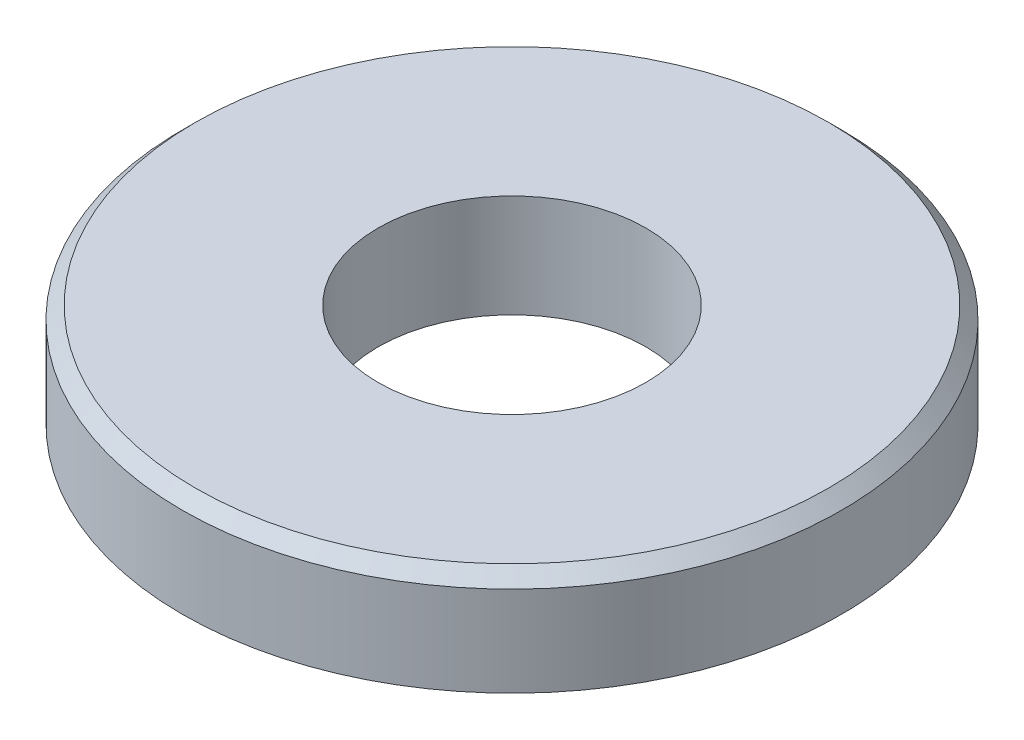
from build123d import *

# Parameters (mm, degrees)
ESQUISSE1_R          = 16
ESQUISSE1_R_2        = 6.5
BASE_EXTRUSION_DEPTH = 5
CHANFREIN3_SIZE      = 0.625


with BuildPart() as part:
    # Esquisse1 → Base-Extrusion (new body)
    with BuildSketch(Plane(origin=(0, 0, 0), x_dir=(1, 0, 0), z_dir=(0, 1, 0))):
        with Locations(Location((0, 0, 0), (0, 0, 270))):
            Circle(ESQUISSE1_R)
        with Locations(Location((0, 0, 0), (0, 0, 270))):
            Circle(ESQUISSE1_R_2, mode=Mode.SUBTRACT)
    extrude(amount=BASE_EXTRUSION_DEPTH)

    # Chanfrein3
    chanfrein3_edges = [part.edges().sort_by_distance(p)[0] for p in [
        (0, 5, -16),
    ]]
    chamfer(chanfrein3_edges, length=CHANFREIN3_SIZE)


solid = part.part
